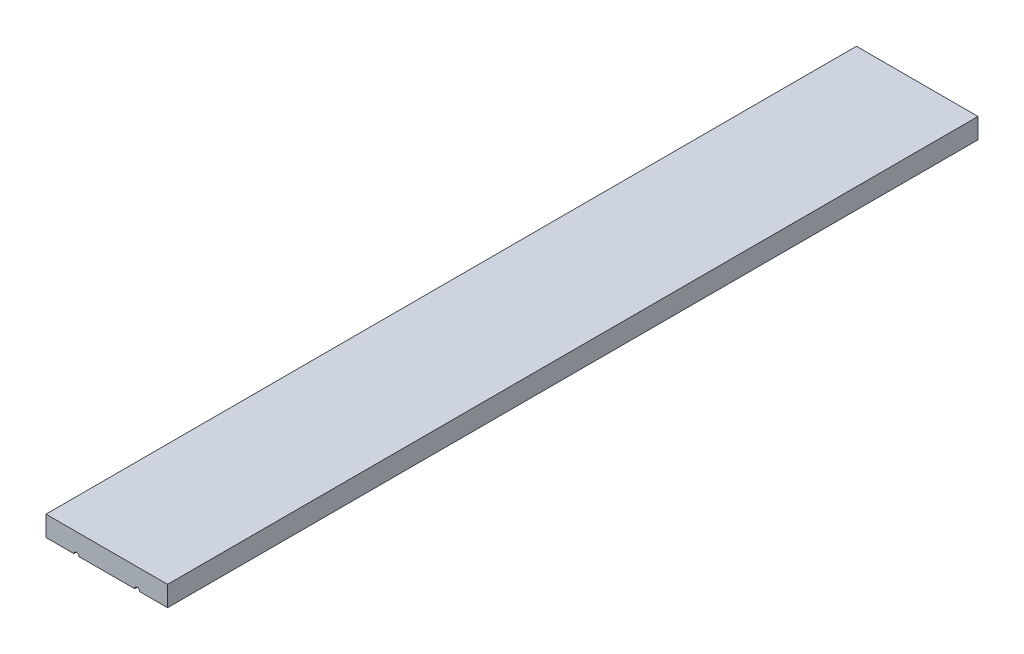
ISO-10303-21;
HEADER;
FILE_DESCRIPTION(('STEP AP214'),'2;1');
FILE_NAME('part.step','',(''),(''),'','','');
FILE_SCHEMA(('AUTOMOTIVE_DESIGN { 1 0 10303 214 1 1 1 1 }'));
ENDSEC;
DATA;
#1=APPLICATION_CONTEXT('core data for automotive mechanical design processes');
#2=APPLICATION_PROTOCOL_DEFINITION('international standard','automotive_design',2000,#1);
#3=PRODUCT_CONTEXT('',#1,'mechanical');
#4=PRODUCT('Part','Part','',(#3));
#5=PRODUCT_RELATED_PRODUCT_CATEGORY('part','',(#4));
#6=PRODUCT_DEFINITION_FORMATION('','',#4);
#7=PRODUCT_DEFINITION_CONTEXT('part definition',#1,'design');
#8=PRODUCT_DEFINITION('design','',#6,#7);
#9=PRODUCT_DEFINITION_SHAPE('','',#8);
#10=(LENGTH_UNIT() NAMED_UNIT(*) SI_UNIT(.MILLI.,.METRE.));
#11=(NAMED_UNIT(*) PLANE_ANGLE_UNIT() SI_UNIT($,.RADIAN.));
#12=(NAMED_UNIT(*) SI_UNIT($,.STERADIAN.) SOLID_ANGLE_UNIT());
#13=UNCERTAINTY_MEASURE_WITH_UNIT(LENGTH_MEASURE(1.E-05),#10,'distance_accuracy_value','');
#14=(GEOMETRIC_REPRESENTATION_CONTEXT(3) GLOBAL_UNCERTAINTY_ASSIGNED_CONTEXT((#13)) GLOBAL_UNIT_ASSIGNED_CONTEXT((#10,
#11,#12)) REPRESENTATION_CONTEXT('',''));
#15=CARTESIAN_POINT('',(0.,0.,0.));
#16=DIRECTION('',(0.,0.,1.));
#17=DIRECTION('',(1.,0.,0.));
#18=AXIS2_PLACEMENT_3D('',#15,#16,#17);
#19=CARTESIAN_POINT('',(-69.520572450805,16.9939177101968,1016.));
#20=DIRECTION('',(0.,1.,0.));
#21=DIRECTION('',(0.,0.,1.));
#22=AXIS2_PLACEMENT_3D('',#19,#20,#21);
#23=PLANE('',#22);
#24=DIRECTION('',(0.,0.,-1.));
#25=VECTOR('',#24,1.);
#26=CARTESIAN_POINT('',(-28.245572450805,16.9939177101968,38.1));
#27=LINE('',#26,#25);
#28=CARTESIAN_POINT('',(-28.245572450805,16.9939177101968,0.));
#29=VERTEX_POINT('',#28);
#30=CARTESIAN_POINT('',(-28.245572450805,16.9939177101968,38.1));
#31=VERTEX_POINT('',#30);
#32=EDGE_CURVE('E156',#29,#31,#27,.F.);
#33=ORIENTED_EDGE('',*,*,#32,.F.);
#34=DIRECTION('',(1.,0.,0.));
#35=VECTOR('',#34,1.);
#36=CARTESIAN_POINT('',(-69.520572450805,16.9939177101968,0.));
#37=LINE('',#36,#35);
#38=CARTESIAN_POINT('',(41.6044275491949,16.9939177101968,0.));
#39=VERTEX_POINT('',#38);
#40=EDGE_CURVE('E148',#29,#39,#37,.T.);
#41=ORIENTED_EDGE('',*,*,#40,.T.);
#42=DIRECTION('',(0.,0.,-1.));
#43=VECTOR('',#42,1.);
#44=CARTESIAN_POINT('',(41.6044275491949,16.9939177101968,38.1));
#45=LINE('',#44,#43);
#46=CARTESIAN_POINT('',(41.6044275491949,16.9939177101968,38.1));
#47=VERTEX_POINT('',#46);
#48=EDGE_CURVE('E60',#47,#39,#45,.T.);
#49=ORIENTED_EDGE('',*,*,#48,.F.);
#50=DIRECTION('',(-1.,0.,0.));
#51=VECTOR('',#50,1.);
#52=CARTESIAN_POINT('',(-69.520572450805,16.9939177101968,38.1));
#53=LINE('',#52,#51);
#54=CARTESIAN_POINT('',(47.9544275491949,16.9939177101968,38.1));
#55=VERTEX_POINT('',#54);
#56=EDGE_CURVE('E53',#55,#47,#53,.T.);
#57=ORIENTED_EDGE('',*,*,#56,.F.);
#58=DIRECTION('',(0.,0.,-1.));
#59=VECTOR('',#58,1.);
#60=CARTESIAN_POINT('',(47.9544275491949,16.9939177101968,38.1));
#61=LINE('',#60,#59);
#62=CARTESIAN_POINT('',(47.9544275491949,16.9939177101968,0.));
#63=VERTEX_POINT('',#62);
#64=EDGE_CURVE('E142',#63,#55,#61,.F.);
#65=ORIENTED_EDGE('',*,*,#64,.F.);
#66=CARTESIAN_POINT('',(82.879427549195,16.9939177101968,0.));
#67=VERTEX_POINT('',#66);
#68=EDGE_CURVE('E195',#63,#67,#37,.T.);
#69=ORIENTED_EDGE('',*,*,#68,.T.);
#70=DIRECTION('',(0.,0.,-1.));
#71=VECTOR('',#70,1.);
#72=CARTESIAN_POINT('',(82.879427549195,16.9939177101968,1016.));
#73=LINE('',#72,#71);
#74=CARTESIAN_POINT('',(82.879427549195,16.9939177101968,1016.));
#75=VERTEX_POINT('',#74);
#76=EDGE_CURVE('E207',#75,#67,#73,.T.);
#77=ORIENTED_EDGE('',*,*,#76,.F.);
#78=DIRECTION('',(1.,0.,0.));
#79=VECTOR('',#78,1.);
#80=CARTESIAN_POINT('',(-69.520572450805,16.9939177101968,1016.));
#81=LINE('',#80,#79);
#82=CARTESIAN_POINT('',(47.9544275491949,16.9939177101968,1016.));
#83=VERTEX_POINT('',#82);
#84=EDGE_CURVE('E182',#83,#75,#81,.T.);
#85=ORIENTED_EDGE('',*,*,#84,.F.);
#86=DIRECTION('',(0.,0.,1.));
#87=VECTOR('',#86,1.);
#88=CARTESIAN_POINT('',(47.9544275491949,16.9939177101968,977.9));
#89=LINE('',#88,#87);
#90=CARTESIAN_POINT('',(47.9544275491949,16.9939177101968,977.9));
#91=VERTEX_POINT('',#90);
#92=EDGE_CURVE('E162',#83,#91,#89,.F.);
#93=ORIENTED_EDGE('',*,*,#92,.T.);
#94=DIRECTION('',(-1.,0.,0.));
#95=VECTOR('',#94,1.);
#96=CARTESIAN_POINT('',(-69.520572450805,16.9939177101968,977.9));
#97=LINE('',#96,#95);
#98=CARTESIAN_POINT('',(41.6044275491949,16.9939177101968,977.9));
#99=VERTEX_POINT('',#98);
#100=EDGE_CURVE('E216',#91,#99,#97,.T.);
#101=ORIENTED_EDGE('',*,*,#100,.T.);
#102=DIRECTION('',(0.,0.,1.));
#103=VECTOR('',#102,1.);
#104=CARTESIAN_POINT('',(41.6044275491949,16.9939177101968,977.9));
#105=LINE('',#104,#103);
#106=CARTESIAN_POINT('',(41.6044275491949,16.9939177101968,1016.));
#107=VERTEX_POINT('',#106);
#108=EDGE_CURVE('E169',#99,#107,#105,.T.);
#109=ORIENTED_EDGE('',*,*,#108,.T.);
#110=CARTESIAN_POINT('',(-28.245572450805,16.9939177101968,1016.));
#111=VERTEX_POINT('',#110);
#112=EDGE_CURVE('E188',#111,#107,#81,.T.);
#113=ORIENTED_EDGE('',*,*,#112,.F.);
#114=DIRECTION('',(0.,0.,1.));
#115=VECTOR('',#114,1.);
#116=CARTESIAN_POINT('',(-28.245572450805,16.9939177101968,977.9));
#117=LINE('',#116,#115);
#118=CARTESIAN_POINT('',(-28.245572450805,16.9939177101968,977.9));
#119=VERTEX_POINT('',#118);
#120=EDGE_CURVE('E172',#111,#119,#117,.F.);
#121=ORIENTED_EDGE('',*,*,#120,.T.);
#122=DIRECTION('',(1.,0.,0.));
#123=VECTOR('',#122,1.);
#124=CARTESIAN_POINT('',(-69.520572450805,16.9939177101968,977.9));
#125=LINE('',#124,#123);
#126=CARTESIAN_POINT('',(-34.595572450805,16.9939177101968,977.9));
#127=VERTEX_POINT('',#126);
#128=EDGE_CURVE('E219',#127,#119,#125,.T.);
#129=ORIENTED_EDGE('',*,*,#128,.F.);
#130=DIRECTION('',(0.,0.,1.));
#131=VECTOR('',#130,1.);
#132=CARTESIAN_POINT('',(-34.595572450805,16.9939177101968,977.9));
#133=LINE('',#132,#131);
#134=CARTESIAN_POINT('',(-34.595572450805,16.9939177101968,1016.));
#135=VERTEX_POINT('',#134);
#136=EDGE_CURVE('E175',#127,#135,#133,.T.);
#137=ORIENTED_EDGE('',*,*,#136,.T.);
#138=CARTESIAN_POINT('',(-69.520572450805,16.9939177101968,1016.));
#139=VERTEX_POINT('',#138);
#140=EDGE_CURVE('E184',#139,#135,#81,.T.);
#141=ORIENTED_EDGE('',*,*,#140,.F.);
#142=DIRECTION('',(0.,0.,-1.));
#143=VECTOR('',#142,1.);
#144=CARTESIAN_POINT('',(-69.520572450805,16.9939177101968,1016.));
#145=LINE('',#144,#143);
#146=CARTESIAN_POINT('',(-69.520572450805,16.9939177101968,0.));
#147=VERTEX_POINT('',#146);
#148=EDGE_CURVE('E210',#139,#147,#145,.T.);
#149=ORIENTED_EDGE('',*,*,#148,.T.);
#150=CARTESIAN_POINT('',(-34.595572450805,16.9939177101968,0.));
#151=VERTEX_POINT('',#150);
#152=EDGE_CURVE('E196',#147,#151,#37,.T.);
#153=ORIENTED_EDGE('',*,*,#152,.T.);
#154=DIRECTION('',(0.,0.,-1.));
#155=VECTOR('',#154,1.);
#156=CARTESIAN_POINT('',(-34.595572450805,16.9939177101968,38.1));
#157=LINE('',#156,#155);
#158=CARTESIAN_POINT('',(-34.595572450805,16.9939177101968,38.1));
#159=VERTEX_POINT('',#158);
#160=EDGE_CURVE('E68',#159,#151,#157,.T.);
#161=ORIENTED_EDGE('',*,*,#160,.F.);
#162=DIRECTION('',(1.,0.,0.));
#163=VECTOR('',#162,1.);
#164=CARTESIAN_POINT('',(-69.520572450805,16.9939177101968,38.1));
#165=LINE('',#164,#163);
#166=EDGE_CURVE('E11',#159,#31,#165,.T.);
#167=ORIENTED_EDGE('',*,*,#166,.T.);
#168=EDGE_LOOP('',(#33,#41,#49,#57,#65,#69,#77,#85,#93,#101,#109,#113,#121,#129,#137,#141,#149,
#153,#161,#167));
#169=FACE_BOUND('',#168,.T.);
#170=ADVANCED_FACE('F45',(#169),#23,.F.);
#171=CARTESIAN_POINT('',(-69.520572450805,16.9939177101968,1016.));
#172=DIRECTION('',(1.,0.,0.));
#173=DIRECTION('',(0.,0.,-1.));
#174=AXIS2_PLACEMENT_3D('',#171,#172,#173);
#175=PLANE('',#174);
#176=DIRECTION('',(0.,-1.,0.));
#177=VECTOR('',#176,1.);
#178=CARTESIAN_POINT('',(-69.520572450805,16.9939177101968,0.));
#179=LINE('',#178,#177);
#180=CARTESIAN_POINT('',(-69.520572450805,42.3939177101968,0.));
#181=VERTEX_POINT('',#180);
#182=EDGE_CURVE('E178',#181,#147,#179,.T.);
#183=ORIENTED_EDGE('',*,*,#182,.T.);
#184=ORIENTED_EDGE('',*,*,#148,.F.);
#185=DIRECTION('',(0.,-1.,0.));
#186=VECTOR('',#185,1.);
#187=CARTESIAN_POINT('',(-69.520572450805,16.9939177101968,1016.));
#188=LINE('',#187,#186);
#189=CARTESIAN_POINT('',(-69.520572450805,42.3939177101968,1016.));
#190=VERTEX_POINT('',#189);
#191=EDGE_CURVE('E179',#190,#139,#188,.T.);
#192=ORIENTED_EDGE('',*,*,#191,.F.);
#193=DIRECTION('',(0.,0.,-1.));
#194=VECTOR('',#193,1.);
#195=CARTESIAN_POINT('',(-69.520572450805,42.3939177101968,1016.));
#196=LINE('',#195,#194);
#197=EDGE_CURVE('E192',#190,#181,#196,.T.);
#198=ORIENTED_EDGE('',*,*,#197,.T.);
#199=EDGE_LOOP('',(#183,#184,#192,#198));
#200=FACE_BOUND('',#199,.T.);
#201=ADVANCED_FACE('F47',(#200),#175,.F.);
#202=CARTESIAN_POINT('',(82.879427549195,16.9939177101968,1016.));
#203=DIRECTION('',(-1.,0.,0.));
#204=DIRECTION('',(0.,-1.,0.));
#205=AXIS2_PLACEMENT_3D('',#202,#203,#204);
#206=PLANE('',#205);
#207=DIRECTION('',(0.,1.,0.));
#208=VECTOR('',#207,1.);
#209=CARTESIAN_POINT('',(82.879427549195,16.9939177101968,0.));
#210=LINE('',#209,#208);
#211=CARTESIAN_POINT('',(82.879427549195,42.3939177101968,0.));
#212=VERTEX_POINT('',#211);
#213=EDGE_CURVE('E199',#67,#212,#210,.T.);
#214=ORIENTED_EDGE('',*,*,#213,.T.);
#215=DIRECTION('',(0.,0.,-1.));
#216=VECTOR('',#215,1.);
#217=CARTESIAN_POINT('',(82.879427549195,42.3939177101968,1016.));
#218=LINE('',#217,#216);
#219=CARTESIAN_POINT('',(82.879427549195,42.3939177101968,1016.));
#220=VERTEX_POINT('',#219);
#221=EDGE_CURVE('E204',#220,#212,#218,.T.);
#222=ORIENTED_EDGE('',*,*,#221,.F.);
#223=DIRECTION('',(0.,1.,0.));
#224=VECTOR('',#223,1.);
#225=CARTESIAN_POINT('',(82.879427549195,16.9939177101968,1016.));
#226=LINE('',#225,#224);
#227=EDGE_CURVE('E187',#75,#220,#226,.T.);
#228=ORIENTED_EDGE('',*,*,#227,.F.);
#229=ORIENTED_EDGE('',*,*,#76,.T.);
#230=EDGE_LOOP('',(#214,#222,#228,#229));
#231=FACE_BOUND('',#230,.T.);
#232=ADVANCED_FACE('F229',(#231),#206,.F.);
#233=CARTESIAN_POINT('',(-69.520572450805,42.3939177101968,1016.));
#234=DIRECTION('',(0.,-1.,0.));
#235=DIRECTION('',(0.,0.,-1.));
#236=AXIS2_PLACEMENT_3D('',#233,#234,#235);
#237=PLANE('',#236);
#238=DIRECTION('',(-1.,0.,0.));
#239=VECTOR('',#238,1.);
#240=CARTESIAN_POINT('',(-69.520572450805,42.3939177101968,0.));
#241=LINE('',#240,#239);
#242=EDGE_CURVE('E183',#212,#181,#241,.T.);
#243=ORIENTED_EDGE('',*,*,#242,.T.);
#244=ORIENTED_EDGE('',*,*,#197,.F.);
#245=DIRECTION('',(-1.,0.,0.));
#246=VECTOR('',#245,1.);
#247=CARTESIAN_POINT('',(-69.520572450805,42.3939177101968,1016.));
#248=LINE('',#247,#246);
#249=EDGE_CURVE('E190',#220,#190,#248,.T.);
#250=ORIENTED_EDGE('',*,*,#249,.F.);
#251=ORIENTED_EDGE('',*,*,#221,.T.);
#252=EDGE_LOOP('',(#243,#244,#250,#251));
#253=FACE_BOUND('',#252,.T.);
#254=ADVANCED_FACE('F235',(#253),#237,.F.);
#255=CARTESIAN_POINT('',(0.,0.,1016.));
#256=DIRECTION('',(0.,0.,-1.));
#257=DIRECTION('',(-1.,0.,0.));
#258=AXIS2_PLACEMENT_3D('',#255,#256,#257);
#259=PLANE('',#258);
#260=ORIENTED_EDGE('',*,*,#140,.T.);
#261=CARTESIAN_POINT('',(-31.420572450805,16.9939177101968,1016.));
#262=DIRECTION('',(0.,0.,1.));
#263=DIRECTION('',(1.,0.,0.));
#264=AXIS2_PLACEMENT_3D('',#261,#262,#263);
#265=CIRCLE('',#264,3.175);
#266=EDGE_CURVE('E163',#111,#135,#265,.T.);
#267=ORIENTED_EDGE('',*,*,#266,.F.);
#268=ORIENTED_EDGE('',*,*,#112,.T.);
#269=CARTESIAN_POINT('',(44.7794275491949,16.9939177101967,1016.));
#270=DIRECTION('',(0.,0.,-1.));
#271=DIRECTION('',(-1.,0.,0.));
#272=AXIS2_PLACEMENT_3D('',#269,#270,#271);
#273=CIRCLE('',#272,3.175);
#274=EDGE_CURVE('E213',#107,#83,#273,.T.);
#275=ORIENTED_EDGE('',*,*,#274,.T.);
#276=ORIENTED_EDGE('',*,*,#84,.T.);
#277=ORIENTED_EDGE('',*,*,#227,.T.);
#278=ORIENTED_EDGE('',*,*,#249,.T.);
#279=ORIENTED_EDGE('',*,*,#191,.T.);
#280=EDGE_LOOP('',(#260,#267,#268,#275,#276,#277,#278,#279));
#281=FACE_BOUND('',#280,.T.);
#282=ADVANCED_FACE('F241',(#281),#259,.F.);
#283=CARTESIAN_POINT('',(0.,0.,0.));
#284=DIRECTION('',(0.,0.,-1.));
#285=DIRECTION('',(-1.,0.,0.));
#286=AXIS2_PLACEMENT_3D('',#283,#284,#285);
#287=PLANE('',#286);
#288=ORIENTED_EDGE('',*,*,#40,.F.);
#289=CARTESIAN_POINT('',(-31.420572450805,16.9939177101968,0.));
#290=DIRECTION('',(0.,0.,1.));
#291=DIRECTION('',(1.,0.,0.));
#292=AXIS2_PLACEMENT_3D('',#289,#290,#291);
#293=CIRCLE('',#292,3.175);
#294=EDGE_CURVE('E143',#29,#151,#293,.T.);
#295=ORIENTED_EDGE('',*,*,#294,.T.);
#296=ORIENTED_EDGE('',*,*,#152,.F.);
#297=ORIENTED_EDGE('',*,*,#182,.F.);
#298=ORIENTED_EDGE('',*,*,#242,.F.);
#299=ORIENTED_EDGE('',*,*,#213,.F.);
#300=ORIENTED_EDGE('',*,*,#68,.F.);
#301=CARTESIAN_POINT('',(44.7794275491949,16.9939177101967,0.));
#302=DIRECTION('',(0.,0.,-1.));
#303=DIRECTION('',(-1.,0.,0.));
#304=AXIS2_PLACEMENT_3D('',#301,#302,#303);
#305=CIRCLE('',#304,3.175);
#306=EDGE_CURVE('E140',#63,#39,#305,.F.);
#307=ORIENTED_EDGE('',*,*,#306,.T.);
#308=EDGE_LOOP('',(#288,#295,#296,#297,#298,#299,#300,#307));
#309=FACE_BOUND('',#308,.T.);
#310=ADVANCED_FACE('F223',(#309),#287,.T.);
#311=CARTESIAN_POINT('',(44.7794275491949,16.9939177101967,977.9));
#312=DIRECTION('',(0.,0.,-1.));
#313=DIRECTION('',(-1.,0.,0.));
#314=AXIS2_PLACEMENT_3D('',#311,#312,#313);
#315=PLANE('',#314);
#316=CARTESIAN_POINT('',(44.7794275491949,16.9939177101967,977.9));
#317=DIRECTION('',(0.,0.,1.));
#318=DIRECTION('',(-1.,0.,0.));
#319=AXIS2_PLACEMENT_3D('',#316,#317,#318);
#320=CIRCLE('',#319,3.175);
#321=EDGE_CURVE('E158',#91,#99,#320,.T.);
#322=ORIENTED_EDGE('',*,*,#321,.T.);
#323=ORIENTED_EDGE('',*,*,#100,.F.);
#324=EDGE_LOOP('',(#322,#323));
#325=FACE_BOUND('',#324,.T.);
#326=ADVANCED_FACE('F250',(#325),#315,.F.);
#327=CARTESIAN_POINT('',(44.7794275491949,16.9939177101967,977.9));
#328=DIRECTION('',(0.,0.,1.));
#329=DIRECTION('',(1.,0.,0.));
#330=AXIS2_PLACEMENT_3D('',#327,#328,#329);
#331=CYLINDRICAL_SURFACE('',#330,3.175);
#332=ORIENTED_EDGE('',*,*,#321,.F.);
#333=ORIENTED_EDGE('',*,*,#92,.F.);
#334=ORIENTED_EDGE('',*,*,#274,.F.);
#335=ORIENTED_EDGE('',*,*,#108,.F.);
#336=EDGE_LOOP('',(#332,#333,#334,#335));
#337=FACE_BOUND('',#336,.T.);
#338=ADVANCED_FACE('F248',(#337),#331,.F.);
#339=CARTESIAN_POINT('',(-31.420572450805,16.9939177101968,977.9));
#340=DIRECTION('',(0.,0.,1.));
#341=DIRECTION('',(1.,0.,0.));
#342=AXIS2_PLACEMENT_3D('',#339,#340,#341);
#343=PLANE('',#342);
#344=ORIENTED_EDGE('',*,*,#128,.T.);
#345=CARTESIAN_POINT('',(-31.420572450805,16.9939177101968,977.9));
#346=DIRECTION('',(0.,0.,1.));
#347=DIRECTION('',(1.,0.,0.));
#348=AXIS2_PLACEMENT_3D('',#345,#346,#347);
#349=CIRCLE('',#348,3.175);
#350=EDGE_CURVE('E159',#119,#127,#349,.T.);
#351=ORIENTED_EDGE('',*,*,#350,.T.);
#352=EDGE_LOOP('',(#344,#351));
#353=FACE_BOUND('',#352,.T.);
#354=ADVANCED_FACE('F257',(#353),#343,.T.);
#355=CARTESIAN_POINT('',(-31.420572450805,16.9939177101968,977.9));
#356=DIRECTION('',(0.,0.,1.));
#357=DIRECTION('',(1.,0.,0.));
#358=AXIS2_PLACEMENT_3D('',#355,#356,#357);
#359=CYLINDRICAL_SURFACE('',#358,3.175);
#360=ORIENTED_EDGE('',*,*,#350,.F.);
#361=ORIENTED_EDGE('',*,*,#120,.F.);
#362=ORIENTED_EDGE('',*,*,#266,.T.);
#363=ORIENTED_EDGE('',*,*,#136,.F.);
#364=EDGE_LOOP('',(#360,#361,#362,#363));
#365=FACE_BOUND('',#364,.T.);
#366=ADVANCED_FACE('F314',(#365),#359,.F.);
#367=CARTESIAN_POINT('',(44.7794275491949,16.9939177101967,38.1));
#368=DIRECTION('',(0.,0.,-1.));
#369=DIRECTION('',(-1.,0.,0.));
#370=AXIS2_PLACEMENT_3D('',#367,#368,#369);
#371=PLANE('',#370);
#372=ORIENTED_EDGE('',*,*,#56,.T.);
#373=CARTESIAN_POINT('',(44.7794275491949,16.9939177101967,38.1));
#374=DIRECTION('',(0.,0.,1.));
#375=DIRECTION('',(-1.,0.,0.));
#376=AXIS2_PLACEMENT_3D('',#373,#374,#375);
#377=CIRCLE('',#376,3.175);
#378=EDGE_CURVE('E137',#55,#47,#377,.T.);
#379=ORIENTED_EDGE('',*,*,#378,.F.);
#380=EDGE_LOOP('',(#372,#379));
#381=FACE_BOUND('',#380,.T.);
#382=ADVANCED_FACE('F136',(#381),#371,.T.);
#383=CARTESIAN_POINT('',(44.7794275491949,16.9939177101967,38.1));
#384=DIRECTION('',(0.,0.,-1.));
#385=DIRECTION('',(-1.,0.,0.));
#386=AXIS2_PLACEMENT_3D('',#383,#384,#385);
#387=CYLINDRICAL_SURFACE('',#386,3.175);
#388=ORIENTED_EDGE('',*,*,#64,.T.);
#389=ORIENTED_EDGE('',*,*,#378,.T.);
#390=ORIENTED_EDGE('',*,*,#48,.T.);
#391=ORIENTED_EDGE('',*,*,#306,.F.);
#392=EDGE_LOOP('',(#388,#389,#390,#391));
#393=FACE_BOUND('',#392,.T.);
#394=ADVANCED_FACE('F141',(#393),#387,.F.);
#395=CARTESIAN_POINT('',(-31.420572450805,16.9939177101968,38.1));
#396=DIRECTION('',(0.,0.,1.));
#397=DIRECTION('',(1.,0.,0.));
#398=AXIS2_PLACEMENT_3D('',#395,#396,#397);
#399=PLANE('',#398);
#400=CARTESIAN_POINT('',(-31.420572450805,16.9939177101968,38.1));
#401=DIRECTION('',(0.,0.,1.));
#402=DIRECTION('',(1.,0.,0.));
#403=AXIS2_PLACEMENT_3D('',#400,#401,#402);
#404=CIRCLE('',#403,3.175);
#405=EDGE_CURVE('E149',#31,#159,#404,.T.);
#406=ORIENTED_EDGE('',*,*,#405,.F.);
#407=ORIENTED_EDGE('',*,*,#166,.F.);
#408=EDGE_LOOP('',(#406,#407));
#409=FACE_BOUND('',#408,.T.);
#410=ADVANCED_FACE('F341',(#409),#399,.F.);
#411=CARTESIAN_POINT('',(-31.420572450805,16.9939177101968,38.1));
#412=DIRECTION('',(0.,0.,-1.));
#413=DIRECTION('',(-1.,0.,0.));
#414=AXIS2_PLACEMENT_3D('',#411,#412,#413);
#415=CYLINDRICAL_SURFACE('',#414,3.175);
#416=ORIENTED_EDGE('',*,*,#32,.T.);
#417=ORIENTED_EDGE('',*,*,#405,.T.);
#418=ORIENTED_EDGE('',*,*,#160,.T.);
#419=ORIENTED_EDGE('',*,*,#294,.F.);
#420=EDGE_LOOP('',(#416,#417,#418,#419));
#421=FACE_BOUND('',#420,.T.);
#422=ADVANCED_FACE('F349',(#421),#415,.F.);
#423=CLOSED_SHELL('',(#170,#201,#232,#254,#282,#310,#326,#338,#354,#366,#382,#394,#410,#422));
#424=MANIFOLD_SOLID_BREP('B2',#423);
#425=ADVANCED_BREP_SHAPE_REPRESENTATION('',(#18,#424),#14);
#426=SHAPE_DEFINITION_REPRESENTATION(#9,#425);
ENDSEC;
END-ISO-10303-21;
